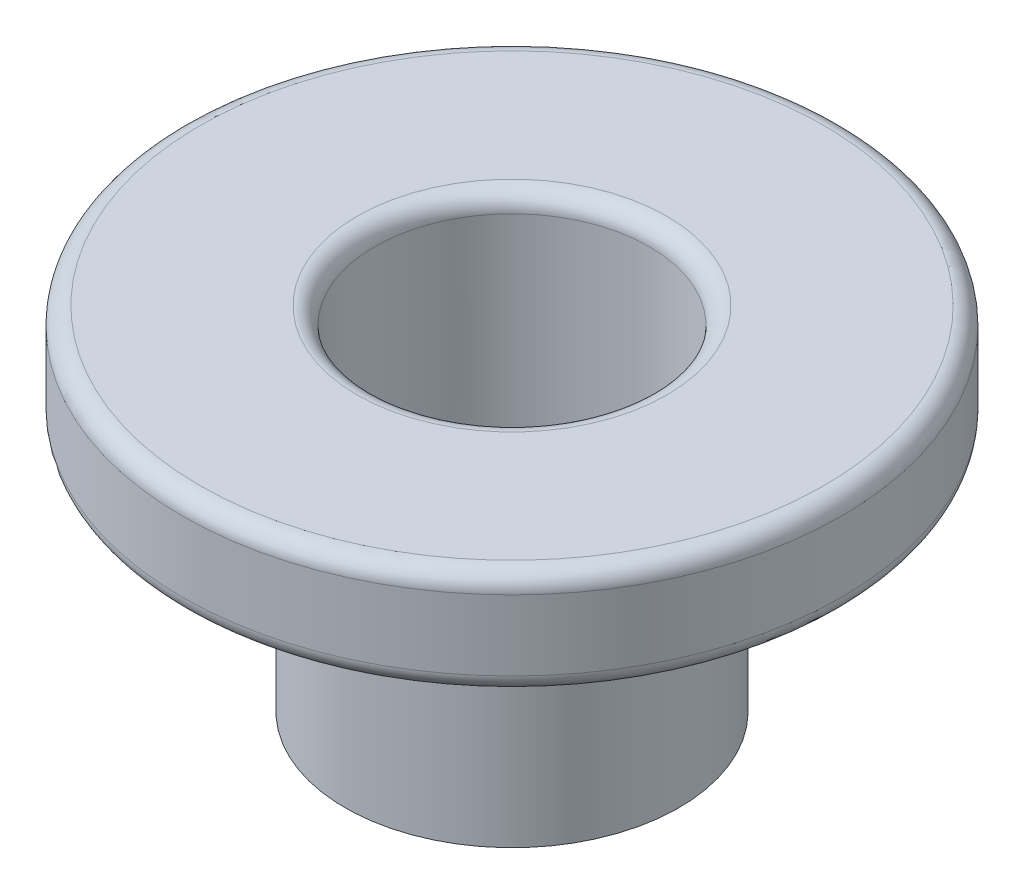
from build123d import *

# Parameters (mm, degrees)
FILLET1_R = 0.254


with BuildPart() as part:
    # Sketch1 → Revolve1 (revolve)
    with BuildSketch(Plane.XY, mode=Mode.PRIVATE) as revolve1_sk:
        Polygon((1.984375, 0), (1.984375, 5.08), (4.7625, 5.08), (4.7625, 3.556), (2.413, 3.556), (2.413, 0), align=None)
    revolve(revolve1_sk.sketch.rotate(Axis((0, 0, 0), (0, 1, 0)), 90), axis=Axis((0, 0, 0), (0, 1, 0)))

    # Fillet1
    fillet1_edges = [part.edges().sort_by_distance(p)[0] for p in [
        (0, 5.08, 1.984375),
        (0, 5.08, 4.7625),
        (0, 3.556, 4.7625),
    ]]
    fillet(fillet1_edges, radius=FILLET1_R)


solid = part.part
